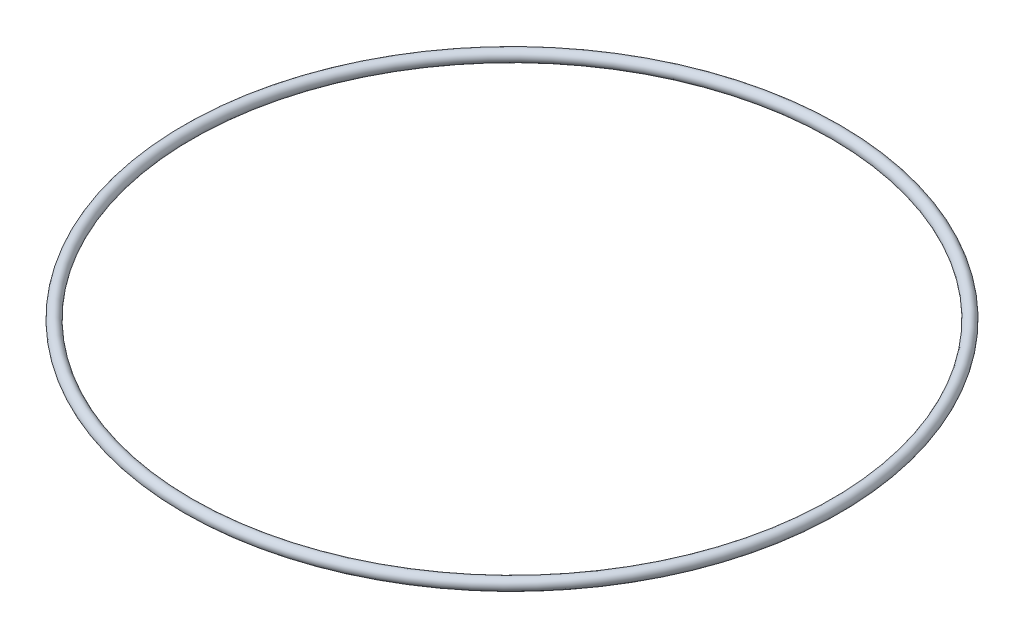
from build123d import *

# Parameters (mm, degrees)
SKETCH1_R = 1.5


with BuildPart() as part:
    # Sketch1 → Ring (revolve)
    with BuildSketch(Plane.XY, mode=Mode.PRIVATE) as ring_sk:
        Circle(SKETCH1_R)
    revolve(ring_sk.sketch.rotate(Axis((-85, 34.141886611, 0), (0, -1, 0)), 90), axis=Axis((-85, 34.141886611, 0), (0, -1, 0)))


solid = part.part
